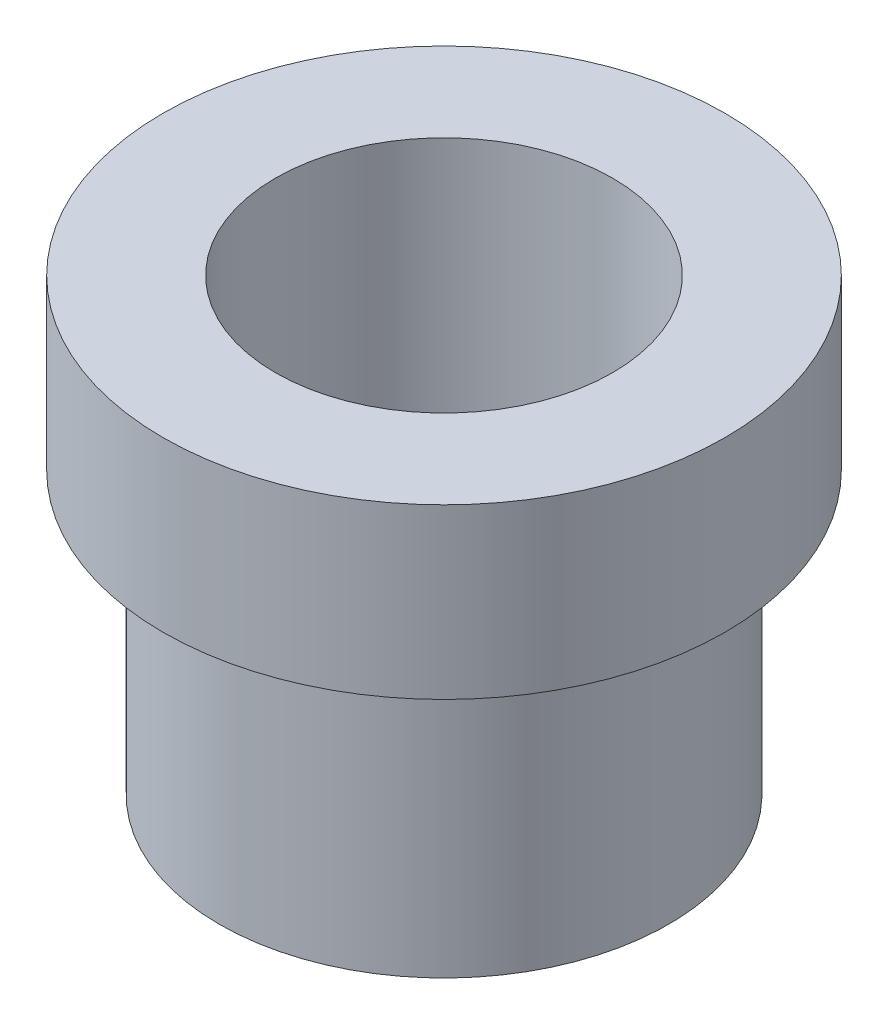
from build123d import *

# Parameters (mm, degrees)
SKETCH1_R           = 4
BOSS_EXTRUDE1_DEPTH = 5
SKETCH2_R           = 5
BOSS_EXTRUDE2_DEPTH = 3
SKETCH3_R           = 3
CUT_EXTRUDE1_DEPTH  = 11.677078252


with BuildPart() as part:
    # Sketch1 → Boss-Extrude1 (new body)
    with BuildSketch(Plane(origin=(0, 0, 0), x_dir=(1, 0, 0), z_dir=(0, 1, 0))):
        with Locations(Location((0, 0, 0), (0, 0, 270))):
            Circle(SKETCH1_R)
    extrude(amount=BOSS_EXTRUDE1_DEPTH)

    # Sketch2 → Boss-Extrude2 (add)
    with BuildSketch(Plane(origin=(0, 5, 0), x_dir=(1, 0, 0), z_dir=(0, 1, 0))):
        with Locations(Location((0, 0, 0), (0, 0, 270))):
            Circle(SKETCH2_R)
    extrude(amount=BOSS_EXTRUDE2_DEPTH)

    # Sketch3 → Cut-Extrude1 (cut, through all)
    with BuildSketch(Plane(origin=(0, 8, 0), x_dir=(1, 0, 0), z_dir=(0, 1, 0))):
        with Locations(Location((0, 0, 0), (0, 0, 270))):
            Circle(SKETCH3_R)
    extrude(amount=-CUT_EXTRUDE1_DEPTH, mode=Mode.SUBTRACT)


solid = part.part
